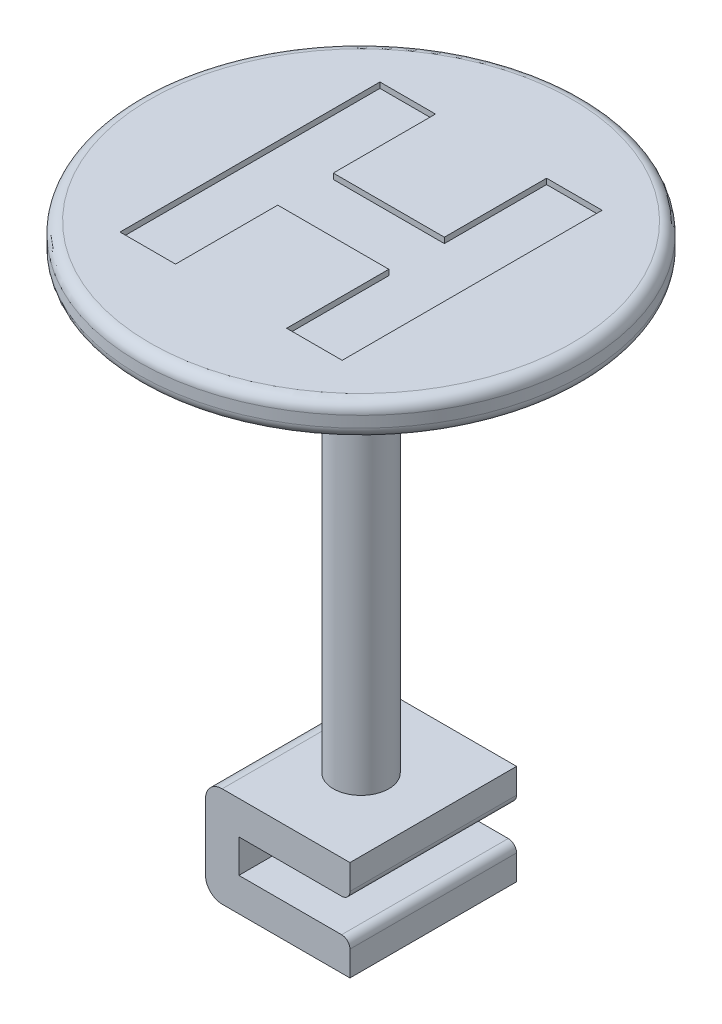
from build123d import *

# Parameters (mm, degrees)
EXTRUDE1_DEPTH     = 15
FILLET2_R          = 0.75
SKETCH4_R          = 2.5
EXTRUDE2_DEPTH     = 40
SKETCH6_R          = 20
EXTRUDE3_DEPTH     = 3
CUT_EXTRUDE1_DEPTH = 0.5
FILLET3_R          = 1.5
FILLET4_R          = 1


with BuildPart() as part:
    # Sketch2 → Extrude1 (new body)
    with BuildSketch(Plane.XY):
        Polygon((-3, 6), (10, 6), (10, 3), (0, 3), (0, 0), (10, 0), (10, -3), (-3, -3), align=None)
    extrude(amount=EXTRUDE1_DEPTH)

    # Fillet2
    fillet2_edges = [part.edges().sort_by_distance(p)[0] for p in [
        (10, 0, 7.5),
        (10, 3, 7.5),
    ]]
    fillet(fillet2_edges, radius=FILLET2_R)

    # Sketch4 → Extrude2 (add)
    with BuildSketch(Plane(origin=(0, 6, 0), x_dir=(-1, 0, 0), z_dir=(0, 1, 0))):
        with Locations(Location((-3.5, 7.5, 0), (0, 0, 270))):
            Circle(SKETCH4_R)
    extrude(amount=EXTRUDE2_DEPTH)

    # Sketch6 → Extrude3 (add)
    with BuildSketch(Plane(origin=(0, 46, 0), x_dir=(-1, 0, 0), z_dir=(0, 1, 0))):
        with Locations(Location((-3.5, 7.5, 0), (0, 0, 90))):
            Circle(SKETCH6_R)
    extrude(amount=EXTRUDE3_DEPTH)

    # Sketch7 → Cut-Extrude1 (cut)
    with BuildSketch(Plane(origin=(0, 49, 0), x_dir=(-1, 0, 0), z_dir=(0, 1, 0))):
        Polygon((-8.5, 10), (1.5, 10), (1.5, 19.198901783), (6.5, 19.198901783), (6.5, -4.198901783), (1.5, -4.198901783), (1.5, 5), (-8.5, 5), (-8.5, -4.198901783), (-13.5, -4.198901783), (-13.5, 19.198901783), (-8.5, 19.198901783), align=None)
    extrude(amount=-CUT_EXTRUDE1_DEPTH, mode=Mode.SUBTRACT)

    # Fillet3
    fillet3_edges = [part.edges().sort_by_distance(p)[0] for p in [
        (-3, -3, 7.5),
        (-3, 6, 7.5),
    ]]
    fillet(fillet3_edges, radius=FILLET3_R)

    # Fillet4
    fillet4_edges = [part.edges().sort_by_distance(p)[0] for p in [
        (3.5, 46, -12.5),
        (3.5, 49, -12.5),
    ]]
    fillet(fillet4_edges, radius=FILLET4_R)


solid = part.part
